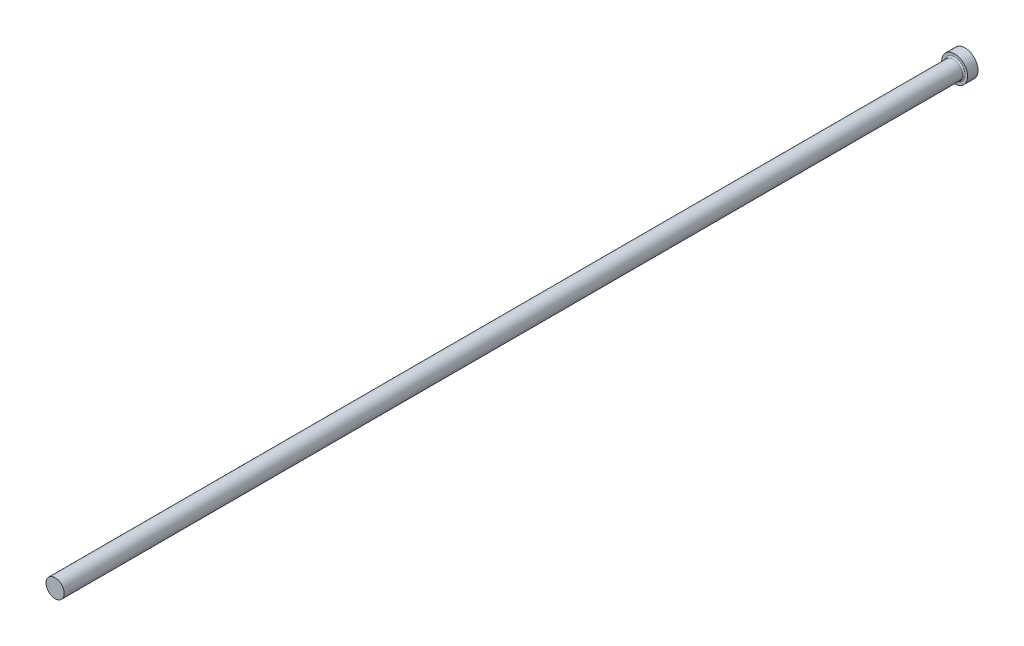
ISO-10303-21;
HEADER;
FILE_DESCRIPTION(('STEP AP214'),'2;1');
FILE_NAME('part.step','',(''),(''),'','','');
FILE_SCHEMA(('AUTOMOTIVE_DESIGN { 1 0 10303 214 1 1 1 1 }'));
ENDSEC;
DATA;
#1=APPLICATION_CONTEXT('core data for automotive mechanical design processes');
#2=APPLICATION_PROTOCOL_DEFINITION('international standard','automotive_design',2000,#1);
#3=PRODUCT_CONTEXT('',#1,'mechanical');
#4=PRODUCT('Part','Part','',(#3));
#5=PRODUCT_RELATED_PRODUCT_CATEGORY('part','',(#4));
#6=PRODUCT_DEFINITION_FORMATION('','',#4);
#7=PRODUCT_DEFINITION_CONTEXT('part definition',#1,'design');
#8=PRODUCT_DEFINITION('design','',#6,#7);
#9=PRODUCT_DEFINITION_SHAPE('','',#8);
#10=(LENGTH_UNIT() NAMED_UNIT(*) SI_UNIT(.MILLI.,.METRE.));
#11=(NAMED_UNIT(*) PLANE_ANGLE_UNIT() SI_UNIT($,.RADIAN.));
#12=(NAMED_UNIT(*) SI_UNIT($,.STERADIAN.) SOLID_ANGLE_UNIT());
#13=UNCERTAINTY_MEASURE_WITH_UNIT(LENGTH_MEASURE(1.E-05),#10,'distance_accuracy_value','');
#14=(GEOMETRIC_REPRESENTATION_CONTEXT(3) GLOBAL_UNCERTAINTY_ASSIGNED_CONTEXT((#13)) GLOBAL_UNIT_ASSIGNED_CONTEXT((#10,
#11,#12)) REPRESENTATION_CONTEXT('',''));
#15=CARTESIAN_POINT('',(0.,0.,0.));
#16=DIRECTION('',(0.,0.,1.));
#17=DIRECTION('',(1.,0.,0.));
#18=AXIS2_PLACEMENT_3D('',#15,#16,#17);
#19=CARTESIAN_POINT('',(5.,0.,4.));
#20=DIRECTION('',(0.,0.,-1.));
#21=DIRECTION('',(-1.,0.,0.));
#22=AXIS2_PLACEMENT_3D('',#19,#20,#21);
#23=PLANE('',#22);
#24=CARTESIAN_POINT('',(0.,0.,4.));
#25=DIRECTION('',(0.,0.,-1.));
#26=DIRECTION('',(-1.,0.,0.));
#27=AXIS2_PLACEMENT_3D('',#24,#25,#26);
#28=CIRCLE('',#27,4.00000000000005);
#29=CARTESIAN_POINT('',(-4.00000000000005,0.,4.));
#30=VERTEX_POINT('',#29);
#31=EDGE_CURVE('E40',#30,#30,#28,.T.);
#32=ORIENTED_EDGE('',*,*,#31,.T.);
#33=EDGE_LOOP('',(#32));
#34=FACE_BOUND('',#33,.T.);
#35=CARTESIAN_POINT('',(0.,0.,4.));
#36=DIRECTION('',(0.,0.,-1.));
#37=DIRECTION('',(-1.,0.,0.));
#38=AXIS2_PLACEMENT_3D('',#35,#36,#37);
#39=CIRCLE('',#38,5.);
#40=CARTESIAN_POINT('',(-5.,0.,4.));
#41=VERTEX_POINT('',#40);
#42=EDGE_CURVE('E44',#41,#41,#39,.T.);
#43=ORIENTED_EDGE('',*,*,#42,.F.);
#44=EDGE_LOOP('',(#43));
#45=FACE_BOUND('',#44,.T.);
#46=ADVANCED_FACE('F33',(#34,#45),#23,.F.);
#47=CARTESIAN_POINT('',(0.,0.,-9.03322817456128));
#48=DIRECTION('',(0.,0.,-1.));
#49=DIRECTION('',(-1.,0.,0.));
#50=AXIS2_PLACEMENT_3D('',#47,#48,#49);
#51=CYLINDRICAL_SURFACE('',#50,5.);
#52=CARTESIAN_POINT('',(0.,0.,0.));
#53=DIRECTION('',(0.,0.,-1.));
#54=DIRECTION('',(-1.,0.,0.));
#55=AXIS2_PLACEMENT_3D('',#52,#53,#54);
#56=CIRCLE('',#55,5.);
#57=CARTESIAN_POINT('',(-5.,0.,0.));
#58=VERTEX_POINT('',#57);
#59=EDGE_CURVE('E48',#58,#58,#56,.T.);
#60=ORIENTED_EDGE('',*,*,#59,.F.);
#61=EDGE_LOOP('',(#60));
#62=FACE_BOUND('',#61,.T.);
#63=ORIENTED_EDGE('',*,*,#42,.T.);
#64=EDGE_LOOP('',(#63));
#65=FACE_BOUND('',#64,.T.);
#66=ADVANCED_FACE('F68',(#62,#65),#51,.T.);
#67=CARTESIAN_POINT('',(0.,0.,0.));
#68=DIRECTION('',(0.,0.,1.));
#69=DIRECTION('',(1.,0.,0.));
#70=AXIS2_PLACEMENT_3D('',#67,#68,#69);
#71=PLANE('',#70);
#72=ORIENTED_EDGE('',*,*,#59,.T.);
#73=EDGE_LOOP('',(#72));
#74=FACE_BOUND('',#73,.T.);
#75=ADVANCED_FACE('F61',(#74),#71,.F.);
#76=CARTESIAN_POINT('',(0.,0.,350.));
#77=DIRECTION('',(0.,0.,-1.));
#78=DIRECTION('',(-1.,0.,0.));
#79=AXIS2_PLACEMENT_3D('',#76,#77,#78);
#80=PLANE('',#79);
#81=CARTESIAN_POINT('',(0.,0.,350.));
#82=DIRECTION('',(0.,0.,-1.));
#83=DIRECTION('',(-1.,0.,0.));
#84=AXIS2_PLACEMENT_3D('',#81,#82,#83);
#85=CIRCLE('',#84,3.50000000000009);
#86=CARTESIAN_POINT('',(-3.50000000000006,0.,350.));
#87=VERTEX_POINT('',#86);
#88=EDGE_CURVE('E53',#87,#87,#85,.T.);
#89=ORIENTED_EDGE('',*,*,#88,.F.);
#90=EDGE_LOOP('',(#89));
#91=FACE_BOUND('',#90,.T.);
#92=ADVANCED_FACE('F59',(#91),#80,.F.);
#93=CARTESIAN_POINT('',(0.,0.,-9.03322817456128));
#94=DIRECTION('',(0.,0.,-1.));
#95=DIRECTION('',(-1.,0.,0.));
#96=AXIS2_PLACEMENT_3D('',#93,#94,#95);
#97=CYLINDRICAL_SURFACE('',#96,3.50000000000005);
#98=CARTESIAN_POINT('',(0.,0.,4.5));
#99=DIRECTION('',(0.,0.,-1.));
#100=DIRECTION('',(-1.,0.,0.));
#101=AXIS2_PLACEMENT_3D('',#98,#99,#100);
#102=CIRCLE('',#101,3.50000000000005);
#103=CARTESIAN_POINT('',(-3.50000000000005,0.,4.5));
#104=VERTEX_POINT('',#103);
#105=EDGE_CURVE('E10',#104,#104,#102,.F.);
#106=ORIENTED_EDGE('',*,*,#105,.T.);
#107=EDGE_LOOP('',(#106));
#108=FACE_BOUND('',#107,.T.);
#109=ORIENTED_EDGE('',*,*,#88,.T.);
#110=EDGE_LOOP('',(#109));
#111=FACE_BOUND('',#110,.T.);
#112=ADVANCED_FACE('F57',(#108,#111),#97,.T.);
#113=CARTESIAN_POINT('',(0.,0.,4.5));
#114=DIRECTION('',(0.,0.,-1.));
#115=DIRECTION('',(-1.,0.,0.));
#116=AXIS2_PLACEMENT_3D('',#113,#114,#115);
#117=TOROIDAL_SURFACE('',#116,4.00000000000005,0.5);
#118=ORIENTED_EDGE('',*,*,#105,.F.);
#119=EDGE_LOOP('',(#118));
#120=FACE_BOUND('',#119,.T.);
#121=ORIENTED_EDGE('',*,*,#31,.F.);
#122=EDGE_LOOP('',(#121));
#123=FACE_BOUND('',#122,.T.);
#124=ADVANCED_FACE('F35',(#120,#123),#117,.F.);
#125=CLOSED_SHELL('',(#46,#66,#75,#92,#112,#124));
#126=MANIFOLD_SOLID_BREP('B2',#125);
#127=ADVANCED_BREP_SHAPE_REPRESENTATION('',(#18,#126),#14);
#128=SHAPE_DEFINITION_REPRESENTATION(#9,#127);
ENDSEC;
END-ISO-10303-21;
